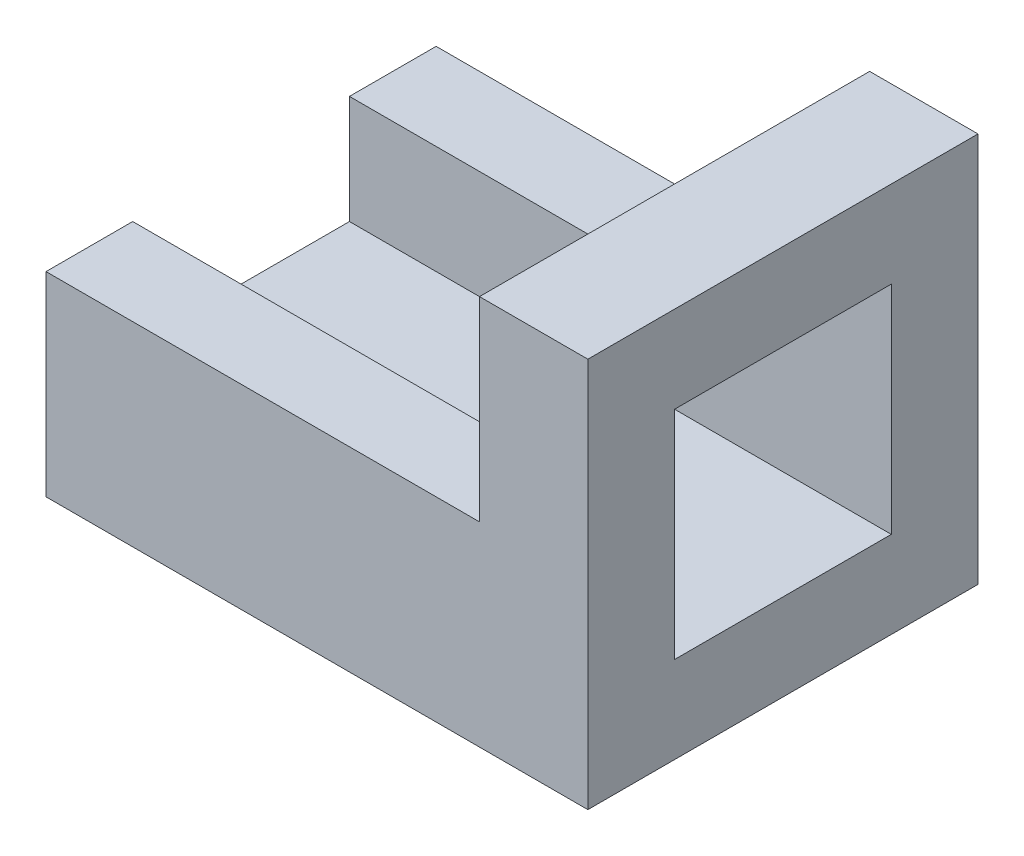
ISO-10303-21;
HEADER;
FILE_DESCRIPTION(('STEP AP214'),'2;1');
FILE_NAME('part.step','',(''),(''),'','','');
FILE_SCHEMA(('AUTOMOTIVE_DESIGN { 1 0 10303 214 1 1 1 1 }'));
ENDSEC;
DATA;
#1=APPLICATION_CONTEXT('core data for automotive mechanical design processes');
#2=APPLICATION_PROTOCOL_DEFINITION('international standard','automotive_design',2000,#1);
#3=PRODUCT_CONTEXT('',#1,'mechanical');
#4=PRODUCT('Part','Part','',(#3));
#5=PRODUCT_RELATED_PRODUCT_CATEGORY('part','',(#4));
#6=PRODUCT_DEFINITION_FORMATION('','',#4);
#7=PRODUCT_DEFINITION_CONTEXT('part definition',#1,'design');
#8=PRODUCT_DEFINITION('design','',#6,#7);
#9=PRODUCT_DEFINITION_SHAPE('','',#8);
#10=(LENGTH_UNIT() NAMED_UNIT(*) SI_UNIT(.MILLI.,.METRE.));
#11=(NAMED_UNIT(*) PLANE_ANGLE_UNIT() SI_UNIT($,.RADIAN.));
#12=(NAMED_UNIT(*) SI_UNIT($,.STERADIAN.) SOLID_ANGLE_UNIT());
#13=UNCERTAINTY_MEASURE_WITH_UNIT(LENGTH_MEASURE(1.E-05),#10,'distance_accuracy_value','');
#14=(GEOMETRIC_REPRESENTATION_CONTEXT(3) GLOBAL_UNCERTAINTY_ASSIGNED_CONTEXT((#13)) GLOBAL_UNIT_ASSIGNED_CONTEXT((#10,
#11,#12)) REPRESENTATION_CONTEXT('',''));
#15=CARTESIAN_POINT('',(0.,0.,0.));
#16=DIRECTION('',(0.,0.,1.));
#17=DIRECTION('',(1.,0.,0.));
#18=AXIS2_PLACEMENT_3D('',#15,#16,#17);
#19=CARTESIAN_POINT('',(80.,36.,36.));
#20=DIRECTION('',(0.,-1.,0.));
#21=DIRECTION('',(1.,0.,0.));
#22=AXIS2_PLACEMENT_3D('',#19,#20,#21);
#23=PLANE('',#22);
#24=DIRECTION('',(0.,0.,-1.));
#25=VECTOR('',#24,1.);
#26=CARTESIAN_POINT('',(80.,36.,36.));
#27=LINE('',#26,#25);
#28=CARTESIAN_POINT('',(80.,36.,36.));
#29=VERTEX_POINT('',#28);
#30=CARTESIAN_POINT('',(80.,36.,20.));
#31=VERTEX_POINT('',#30);
#32=EDGE_CURVE('E193',#29,#31,#27,.T.);
#33=ORIENTED_EDGE('',*,*,#32,.T.);
#34=DIRECTION('',(-1.,0.,0.));
#35=VECTOR('',#34,1.);
#36=CARTESIAN_POINT('',(80.,36.,20.));
#37=LINE('',#36,#35);
#38=CARTESIAN_POINT('',(0.,36.,20.));
#39=VERTEX_POINT('',#38);
#40=EDGE_CURVE('E39',#31,#39,#37,.T.);
#41=ORIENTED_EDGE('',*,*,#40,.T.);
#42=DIRECTION('',(0.,0.,-1.));
#43=VECTOR('',#42,1.);
#44=CARTESIAN_POINT('',(0.,36.,36.));
#45=LINE('',#44,#43);
#46=CARTESIAN_POINT('',(0.,36.,36.));
#47=VERTEX_POINT('',#46);
#48=EDGE_CURVE('E140',#47,#39,#45,.T.);
#49=ORIENTED_EDGE('',*,*,#48,.F.);
#50=DIRECTION('',(-1.,0.,0.));
#51=VECTOR('',#50,1.);
#52=CARTESIAN_POINT('',(80.,36.,36.));
#53=LINE('',#52,#51);
#54=EDGE_CURVE('E175',#29,#47,#53,.T.);
#55=ORIENTED_EDGE('',*,*,#54,.F.);
#56=EDGE_LOOP('',(#33,#41,#49,#55));
#57=FACE_BOUND('',#56,.T.);
#58=ADVANCED_FACE('F31',(#57),#23,.F.);
#59=CARTESIAN_POINT('',(0.,0.,36.));
#60=DIRECTION('',(1.,0.,0.));
#61=DIRECTION('',(0.,0.,-1.));
#62=AXIS2_PLACEMENT_3D('',#59,#60,#61);
#63=PLANE('',#62);
#64=ORIENTED_EDGE('',*,*,#48,.T.);
#65=DIRECTION('',(0.,-1.,0.));
#66=VECTOR('',#65,1.);
#67=CARTESIAN_POINT('',(0.,56.,20.));
#68=LINE('',#67,#66);
#69=CARTESIAN_POINT('',(0.,16.,20.));
#70=VERTEX_POINT('',#69);
#71=EDGE_CURVE('E122',#39,#70,#68,.T.);
#72=ORIENTED_EDGE('',*,*,#71,.T.);
#73=DIRECTION('',(0.,0.,-1.));
#74=VECTOR('',#73,1.);
#75=CARTESIAN_POINT('',(0.,16.,20.));
#76=LINE('',#75,#74);
#77=CARTESIAN_POINT('',(0.,16.,-20.));
#78=VERTEX_POINT('',#77);
#79=EDGE_CURVE('E131',#70,#78,#76,.T.);
#80=ORIENTED_EDGE('',*,*,#79,.T.);
#81=DIRECTION('',(0.,1.,0.));
#82=VECTOR('',#81,1.);
#83=CARTESIAN_POINT('',(0.,56.,-20.));
#84=LINE('',#83,#82);
#85=CARTESIAN_POINT('',(0.,36.,-20.));
#86=VERTEX_POINT('',#85);
#87=EDGE_CURVE('E128',#78,#86,#84,.T.);
#88=ORIENTED_EDGE('',*,*,#87,.T.);
#89=CARTESIAN_POINT('',(0.,36.,-36.));
#90=VERTEX_POINT('',#89);
#91=EDGE_CURVE('E177',#86,#90,#45,.T.);
#92=ORIENTED_EDGE('',*,*,#91,.T.);
#93=DIRECTION('',(0.,-1.,0.));
#94=VECTOR('',#93,1.);
#95=CARTESIAN_POINT('',(0.,0.,-36.));
#96=LINE('',#95,#94);
#97=CARTESIAN_POINT('',(0.,0.,-36.));
#98=VERTEX_POINT('',#97);
#99=EDGE_CURVE('E162',#90,#98,#96,.T.);
#100=ORIENTED_EDGE('',*,*,#99,.T.);
#101=DIRECTION('',(0.,0.,-1.));
#102=VECTOR('',#101,1.);
#103=CARTESIAN_POINT('',(0.,0.,36.));
#104=LINE('',#103,#102);
#105=CARTESIAN_POINT('',(0.,0.,36.));
#106=VERTEX_POINT('',#105);
#107=EDGE_CURVE('E205',#106,#98,#104,.T.);
#108=ORIENTED_EDGE('',*,*,#107,.F.);
#109=DIRECTION('',(0.,-1.,0.));
#110=VECTOR('',#109,1.);
#111=CARTESIAN_POINT('',(0.,0.,36.));
#112=LINE('',#111,#110);
#113=EDGE_CURVE('E163',#47,#106,#112,.T.);
#114=ORIENTED_EDGE('',*,*,#113,.F.);
#115=EDGE_LOOP('',(#64,#72,#80,#88,#92,#100,#108,#114));
#116=FACE_BOUND('',#115,.T.);
#117=ADVANCED_FACE('F33',(#116),#63,.F.);
#118=CARTESIAN_POINT('',(0.,0.,36.));
#119=DIRECTION('',(0.,1.,0.));
#120=DIRECTION('',(0.,0.,1.));
#121=AXIS2_PLACEMENT_3D('',#118,#119,#120);
#122=PLANE('',#121);
#123=DIRECTION('',(1.,0.,0.));
#124=VECTOR('',#123,1.);
#125=CARTESIAN_POINT('',(0.,0.,-36.));
#126=LINE('',#125,#124);
#127=CARTESIAN_POINT('',(100.,0.,-36.));
#128=VERTEX_POINT('',#127);
#129=EDGE_CURVE('E180',#98,#128,#126,.T.);
#130=ORIENTED_EDGE('',*,*,#129,.T.);
#131=DIRECTION('',(0.,0.,-1.));
#132=VECTOR('',#131,1.);
#133=CARTESIAN_POINT('',(100.,0.,36.));
#134=LINE('',#133,#132);
#135=CARTESIAN_POINT('',(100.,0.,36.));
#136=VERTEX_POINT('',#135);
#137=EDGE_CURVE('E202',#136,#128,#134,.T.);
#138=ORIENTED_EDGE('',*,*,#137,.F.);
#139=DIRECTION('',(1.,0.,0.));
#140=VECTOR('',#139,1.);
#141=CARTESIAN_POINT('',(0.,0.,36.));
#142=LINE('',#141,#140);
#143=EDGE_CURVE('E166',#106,#136,#142,.T.);
#144=ORIENTED_EDGE('',*,*,#143,.F.);
#145=ORIENTED_EDGE('',*,*,#107,.T.);
#146=EDGE_LOOP('',(#130,#138,#144,#145));
#147=FACE_BOUND('',#146,.T.);
#148=ADVANCED_FACE('F227',(#147),#122,.F.);
#149=CARTESIAN_POINT('',(100.,0.,36.));
#150=DIRECTION('',(-1.,0.,0.));
#151=DIRECTION('',(0.,0.,1.));
#152=AXIS2_PLACEMENT_3D('',#149,#150,#151);
#153=PLANE('',#152);
#154=DIRECTION('',(0.,0.,-1.));
#155=VECTOR('',#154,1.);
#156=CARTESIAN_POINT('',(100.,16.,20.));
#157=LINE('',#156,#155);
#158=CARTESIAN_POINT('',(100.,16.,20.));
#159=VERTEX_POINT('',#158);
#160=CARTESIAN_POINT('',(100.,16.,-20.));
#161=VERTEX_POINT('',#160);
#162=EDGE_CURVE('E149',#159,#161,#157,.T.);
#163=ORIENTED_EDGE('',*,*,#162,.F.);
#164=DIRECTION('',(0.,-1.,0.));
#165=VECTOR('',#164,1.);
#166=CARTESIAN_POINT('',(100.,56.,20.));
#167=LINE('',#166,#165);
#168=CARTESIAN_POINT('',(100.,56.,20.));
#169=VERTEX_POINT('',#168);
#170=EDGE_CURVE('E46',#169,#159,#167,.T.);
#171=ORIENTED_EDGE('',*,*,#170,.F.);
#172=DIRECTION('',(0.,0.,1.));
#173=VECTOR('',#172,1.);
#174=CARTESIAN_POINT('',(100.,56.,20.));
#175=LINE('',#174,#173);
#176=CARTESIAN_POINT('',(100.,56.,-20.));
#177=VERTEX_POINT('',#176);
#178=EDGE_CURVE('E141',#177,#169,#175,.T.);
#179=ORIENTED_EDGE('',*,*,#178,.F.);
#180=DIRECTION('',(0.,1.,0.));
#181=VECTOR('',#180,1.);
#182=CARTESIAN_POINT('',(100.,56.,-20.));
#183=LINE('',#182,#181);
#184=EDGE_CURVE('E144',#161,#177,#183,.T.);
#185=ORIENTED_EDGE('',*,*,#184,.F.);
#186=EDGE_LOOP('',(#163,#171,#179,#185));
#187=FACE_BOUND('',#186,.T.);
#188=DIRECTION('',(0.,1.,0.));
#189=VECTOR('',#188,1.);
#190=CARTESIAN_POINT('',(100.,0.,-36.));
#191=LINE('',#190,#189);
#192=CARTESIAN_POINT('',(100.,72.,-36.));
#193=VERTEX_POINT('',#192);
#194=EDGE_CURVE('E182',#128,#193,#191,.T.);
#195=ORIENTED_EDGE('',*,*,#194,.T.);
#196=DIRECTION('',(0.,0.,-1.));
#197=VECTOR('',#196,1.);
#198=CARTESIAN_POINT('',(100.,72.,36.));
#199=LINE('',#198,#197);
#200=CARTESIAN_POINT('',(100.,72.,36.));
#201=VERTEX_POINT('',#200);
#202=EDGE_CURVE('E199',#201,#193,#199,.T.);
#203=ORIENTED_EDGE('',*,*,#202,.F.);
#204=DIRECTION('',(0.,1.,0.));
#205=VECTOR('',#204,1.);
#206=CARTESIAN_POINT('',(100.,0.,36.));
#207=LINE('',#206,#205);
#208=EDGE_CURVE('E169',#136,#201,#207,.T.);
#209=ORIENTED_EDGE('',*,*,#208,.F.);
#210=ORIENTED_EDGE('',*,*,#137,.T.);
#211=EDGE_LOOP('',(#195,#203,#209,#210));
#212=FACE_BOUND('',#211,.T.);
#213=ADVANCED_FACE('F223',(#187,#212),#153,.F.);
#214=CARTESIAN_POINT('',(80.,72.,36.));
#215=DIRECTION('',(0.,-1.,0.));
#216=DIRECTION('',(0.,0.,-1.));
#217=AXIS2_PLACEMENT_3D('',#214,#215,#216);
#218=PLANE('',#217);
#219=DIRECTION('',(-1.,0.,0.));
#220=VECTOR('',#219,1.);
#221=CARTESIAN_POINT('',(80.,72.,-36.));
#222=LINE('',#221,#220);
#223=CARTESIAN_POINT('',(80.,72.,-36.));
#224=VERTEX_POINT('',#223);
#225=EDGE_CURVE('E184',#193,#224,#222,.T.);
#226=ORIENTED_EDGE('',*,*,#225,.T.);
#227=DIRECTION('',(0.,0.,-1.));
#228=VECTOR('',#227,1.);
#229=CARTESIAN_POINT('',(80.,72.,36.));
#230=LINE('',#229,#228);
#231=CARTESIAN_POINT('',(80.,72.,36.));
#232=VERTEX_POINT('',#231);
#233=EDGE_CURVE('E196',#232,#224,#230,.T.);
#234=ORIENTED_EDGE('',*,*,#233,.F.);
#235=DIRECTION('',(-1.,0.,0.));
#236=VECTOR('',#235,1.);
#237=CARTESIAN_POINT('',(80.,72.,36.));
#238=LINE('',#237,#236);
#239=EDGE_CURVE('E171',#201,#232,#238,.T.);
#240=ORIENTED_EDGE('',*,*,#239,.F.);
#241=ORIENTED_EDGE('',*,*,#202,.T.);
#242=EDGE_LOOP('',(#226,#234,#240,#241));
#243=FACE_BOUND('',#242,.T.);
#244=ADVANCED_FACE('F226',(#243),#218,.F.);
#245=CARTESIAN_POINT('',(80.,72.,36.));
#246=DIRECTION('',(1.,0.,0.));
#247=DIRECTION('',(0.,0.,-1.));
#248=AXIS2_PLACEMENT_3D('',#245,#246,#247);
#249=PLANE('',#248);
#250=DIRECTION('',(0.,0.,1.));
#251=VECTOR('',#250,1.);
#252=CARTESIAN_POINT('',(80.,56.,36.));
#253=LINE('',#252,#251);
#254=CARTESIAN_POINT('',(80.,56.,-20.));
#255=VERTEX_POINT('',#254);
#256=CARTESIAN_POINT('',(80.,56.,20.));
#257=VERTEX_POINT('',#256);
#258=EDGE_CURVE('E11',#255,#257,#253,.T.);
#259=ORIENTED_EDGE('',*,*,#258,.T.);
#260=DIRECTION('',(0.,-1.,0.));
#261=VECTOR('',#260,1.);
#262=CARTESIAN_POINT('',(80.,72.,20.));
#263=LINE('',#262,#261);
#264=EDGE_CURVE('E159',#257,#31,#263,.T.);
#265=ORIENTED_EDGE('',*,*,#264,.T.);
#266=ORIENTED_EDGE('',*,*,#32,.F.);
#267=DIRECTION('',(0.,-1.,0.));
#268=VECTOR('',#267,1.);
#269=CARTESIAN_POINT('',(80.,72.,36.));
#270=LINE('',#269,#268);
#271=EDGE_CURVE('E173',#232,#29,#270,.T.);
#272=ORIENTED_EDGE('',*,*,#271,.F.);
#273=ORIENTED_EDGE('',*,*,#233,.T.);
#274=DIRECTION('',(0.,-1.,0.));
#275=VECTOR('',#274,1.);
#276=CARTESIAN_POINT('',(80.,72.,-36.));
#277=LINE('',#276,#275);
#278=CARTESIAN_POINT('',(80.,36.,-36.));
#279=VERTEX_POINT('',#278);
#280=EDGE_CURVE('E186',#224,#279,#277,.T.);
#281=ORIENTED_EDGE('',*,*,#280,.T.);
#282=CARTESIAN_POINT('',(80.,36.,-20.));
#283=VERTEX_POINT('',#282);
#284=EDGE_CURVE('E192',#283,#279,#27,.T.);
#285=ORIENTED_EDGE('',*,*,#284,.F.);
#286=DIRECTION('',(0.,1.,0.));
#287=VECTOR('',#286,1.);
#288=CARTESIAN_POINT('',(80.,72.,-20.));
#289=LINE('',#288,#287);
#290=EDGE_CURVE('E54',#283,#255,#289,.T.);
#291=ORIENTED_EDGE('',*,*,#290,.T.);
#292=EDGE_LOOP('',(#259,#265,#266,#272,#273,#281,#285,#291));
#293=FACE_BOUND('',#292,.T.);
#294=ADVANCED_FACE('F214',(#293),#249,.F.);
#295=ORIENTED_EDGE('',*,*,#91,.F.);
#296=DIRECTION('',(1.,0.,0.));
#297=VECTOR('',#296,1.);
#298=CARTESIAN_POINT('',(80.,36.,-20.));
#299=LINE('',#298,#297);
#300=EDGE_CURVE('E208',#86,#283,#299,.T.);
#301=ORIENTED_EDGE('',*,*,#300,.T.);
#302=ORIENTED_EDGE('',*,*,#284,.T.);
#303=DIRECTION('',(-1.,0.,0.));
#304=VECTOR('',#303,1.);
#305=CARTESIAN_POINT('',(80.,36.,-36.));
#306=LINE('',#305,#304);
#307=EDGE_CURVE('E167',#279,#90,#306,.T.);
#308=ORIENTED_EDGE('',*,*,#307,.T.);
#309=EDGE_LOOP('',(#295,#301,#302,#308));
#310=FACE_BOUND('',#309,.T.);
#311=ADVANCED_FACE('F248',(#310),#23,.F.);
#312=CARTESIAN_POINT('',(0.,72.,36.));
#313=DIRECTION('',(0.,0.,-1.));
#314=DIRECTION('',(-1.,0.,0.));
#315=AXIS2_PLACEMENT_3D('',#312,#313,#314);
#316=PLANE('',#315);
#317=ORIENTED_EDGE('',*,*,#113,.T.);
#318=ORIENTED_EDGE('',*,*,#143,.T.);
#319=ORIENTED_EDGE('',*,*,#208,.T.);
#320=ORIENTED_EDGE('',*,*,#239,.T.);
#321=ORIENTED_EDGE('',*,*,#271,.T.);
#322=ORIENTED_EDGE('',*,*,#54,.T.);
#323=EDGE_LOOP('',(#317,#318,#319,#320,#321,#322));
#324=FACE_BOUND('',#323,.T.);
#325=ADVANCED_FACE('F243',(#324),#316,.F.);
#326=CARTESIAN_POINT('',(0.,72.,-36.));
#327=DIRECTION('',(0.,0.,-1.));
#328=DIRECTION('',(-1.,0.,0.));
#329=AXIS2_PLACEMENT_3D('',#326,#327,#328);
#330=PLANE('',#329);
#331=ORIENTED_EDGE('',*,*,#99,.F.);
#332=ORIENTED_EDGE('',*,*,#307,.F.);
#333=ORIENTED_EDGE('',*,*,#280,.F.);
#334=ORIENTED_EDGE('',*,*,#225,.F.);
#335=ORIENTED_EDGE('',*,*,#194,.F.);
#336=ORIENTED_EDGE('',*,*,#129,.F.);
#337=EDGE_LOOP('',(#331,#332,#333,#334,#335,#336));
#338=FACE_BOUND('',#337,.T.);
#339=ADVANCED_FACE('F240',(#338),#330,.T.);
#340=CARTESIAN_POINT('',(0.,56.,20.));
#341=DIRECTION('',(0.,1.,0.));
#342=DIRECTION('',(0.,0.,1.));
#343=AXIS2_PLACEMENT_3D('',#340,#341,#342);
#344=PLANE('',#343);
#345=DIRECTION('',(1.,0.,0.));
#346=VECTOR('',#345,1.);
#347=CARTESIAN_POINT('',(0.,56.,-20.));
#348=LINE('',#347,#346);
#349=EDGE_CURVE('E155',#255,#177,#348,.T.);
#350=ORIENTED_EDGE('',*,*,#349,.T.);
#351=ORIENTED_EDGE('',*,*,#178,.T.);
#352=DIRECTION('',(1.,0.,0.));
#353=VECTOR('',#352,1.);
#354=CARTESIAN_POINT('',(0.,56.,20.));
#355=LINE('',#354,#353);
#356=EDGE_CURVE('E153',#257,#169,#355,.T.);
#357=ORIENTED_EDGE('',*,*,#356,.F.);
#358=ORIENTED_EDGE('',*,*,#258,.F.);
#359=EDGE_LOOP('',(#350,#351,#357,#358));
#360=FACE_BOUND('',#359,.T.);
#361=ADVANCED_FACE('F218',(#360),#344,.F.);
#362=CARTESIAN_POINT('',(0.,56.,20.));
#363=DIRECTION('',(0.,0.,1.));
#364=DIRECTION('',(0.,-1.,0.));
#365=AXIS2_PLACEMENT_3D('',#362,#363,#364);
#366=PLANE('',#365);
#367=ORIENTED_EDGE('',*,*,#356,.T.);
#368=ORIENTED_EDGE('',*,*,#170,.T.);
#369=DIRECTION('',(1.,0.,0.));
#370=VECTOR('',#369,1.);
#371=CARTESIAN_POINT('',(0.,16.,20.));
#372=LINE('',#371,#370);
#373=EDGE_CURVE('E118',#70,#159,#372,.T.);
#374=ORIENTED_EDGE('',*,*,#373,.F.);
#375=ORIENTED_EDGE('',*,*,#71,.F.);
#376=ORIENTED_EDGE('',*,*,#40,.F.);
#377=ORIENTED_EDGE('',*,*,#264,.F.);
#378=EDGE_LOOP('',(#367,#368,#374,#375,#376,#377));
#379=FACE_BOUND('',#378,.T.);
#380=ADVANCED_FACE('F120',(#379),#366,.F.);
#381=CARTESIAN_POINT('',(0.,56.,-20.));
#382=DIRECTION('',(0.,0.,-1.));
#383=DIRECTION('',(0.,1.,0.));
#384=AXIS2_PLACEMENT_3D('',#381,#382,#383);
#385=PLANE('',#384);
#386=ORIENTED_EDGE('',*,*,#300,.F.);
#387=ORIENTED_EDGE('',*,*,#87,.F.);
#388=DIRECTION('',(1.,0.,0.));
#389=VECTOR('',#388,1.);
#390=CARTESIAN_POINT('',(0.,16.,-20.));
#391=LINE('',#390,#389);
#392=EDGE_CURVE('E127',#78,#161,#391,.T.);
#393=ORIENTED_EDGE('',*,*,#392,.T.);
#394=ORIENTED_EDGE('',*,*,#184,.T.);
#395=ORIENTED_EDGE('',*,*,#349,.F.);
#396=ORIENTED_EDGE('',*,*,#290,.F.);
#397=EDGE_LOOP('',(#386,#387,#393,#394,#395,#396));
#398=FACE_BOUND('',#397,.T.);
#399=ADVANCED_FACE('F219',(#398),#385,.F.);
#400=CARTESIAN_POINT('',(0.,16.,20.));
#401=DIRECTION('',(0.,-1.,0.));
#402=DIRECTION('',(0.,0.,-1.));
#403=AXIS2_PLACEMENT_3D('',#400,#401,#402);
#404=PLANE('',#403);
#405=ORIENTED_EDGE('',*,*,#162,.T.);
#406=ORIENTED_EDGE('',*,*,#392,.F.);
#407=ORIENTED_EDGE('',*,*,#79,.F.);
#408=ORIENTED_EDGE('',*,*,#373,.T.);
#409=EDGE_LOOP('',(#405,#406,#407,#408));
#410=FACE_BOUND('',#409,.T.);
#411=ADVANCED_FACE('F132',(#410),#404,.F.);
#412=CLOSED_SHELL('',(#58,#117,#148,#213,#244,#294,#311,#325,#339,#361,#380,#399,#411));
#413=MANIFOLD_SOLID_BREP('B2',#412);
#414=ADVANCED_BREP_SHAPE_REPRESENTATION('',(#18,#413),#14);
#415=SHAPE_DEFINITION_REPRESENTATION(#9,#414);
ENDSEC;
END-ISO-10303-21;
